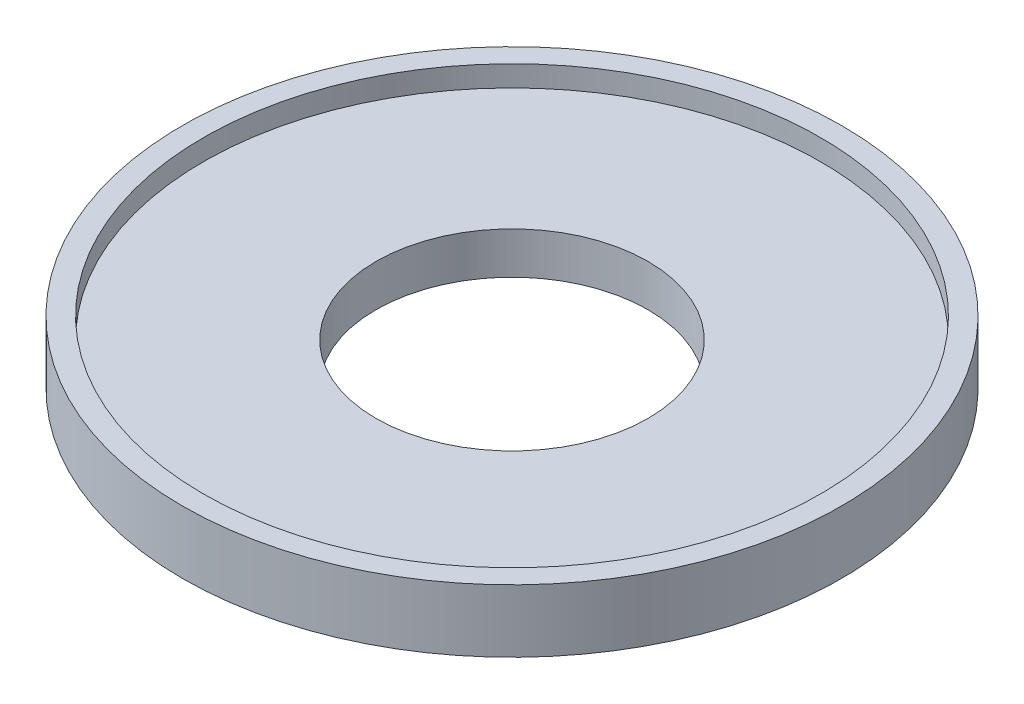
from build123d import *

# Parameters (mm, degrees)
SZKIC1_R                    = 31.5
DODANIE_WYCI_GNI_CIE1_DEPTH = 6
SZKIC2_R                    = 13
WYTNIJ_WYCI_GNI_CIE1_DEPTH  = 6
SZKIC3_R                    = 29.5
WYTNIJ_WYCI_GNI_CIE2_DEPTH  = 2


with BuildPart() as part:
    # Szkic1 → Dodanie-wyci_gni_cie1 (new body)
    with BuildSketch(Plane(origin=(0, 0, 0), x_dir=(1, 0, 0), z_dir=(0, 1, 0))):
        with Locations(Location((0, 0, 0), (0, 0, 270))):
            Circle(SZKIC1_R)
    extrude(amount=DODANIE_WYCI_GNI_CIE1_DEPTH)

    # Szkic2 → Wytnij-wyci_gni_cie1 (cut)
    with BuildSketch(Plane(origin=(0, 6, 0), x_dir=(1, 0, 0), z_dir=(0, 1, 0))):
        with Locations(Location((0, 0, 0), (0, 0, 270))):
            Circle(SZKIC2_R)
    extrude(amount=-WYTNIJ_WYCI_GNI_CIE1_DEPTH, mode=Mode.SUBTRACT)

    # Szkic3 → Wytnij-wyci_gni_cie2 (cut)
    with BuildSketch(Plane(origin=(0, 6, 0), x_dir=(1, 0, 0), z_dir=(0, 1, 0))):
        with Locations(Location((0, 0, 0), (0, 0, 270))):
            Circle(SZKIC3_R)
    extrude(amount=-WYTNIJ_WYCI_GNI_CIE2_DEPTH, mode=Mode.SUBTRACT)


solid = part.part
